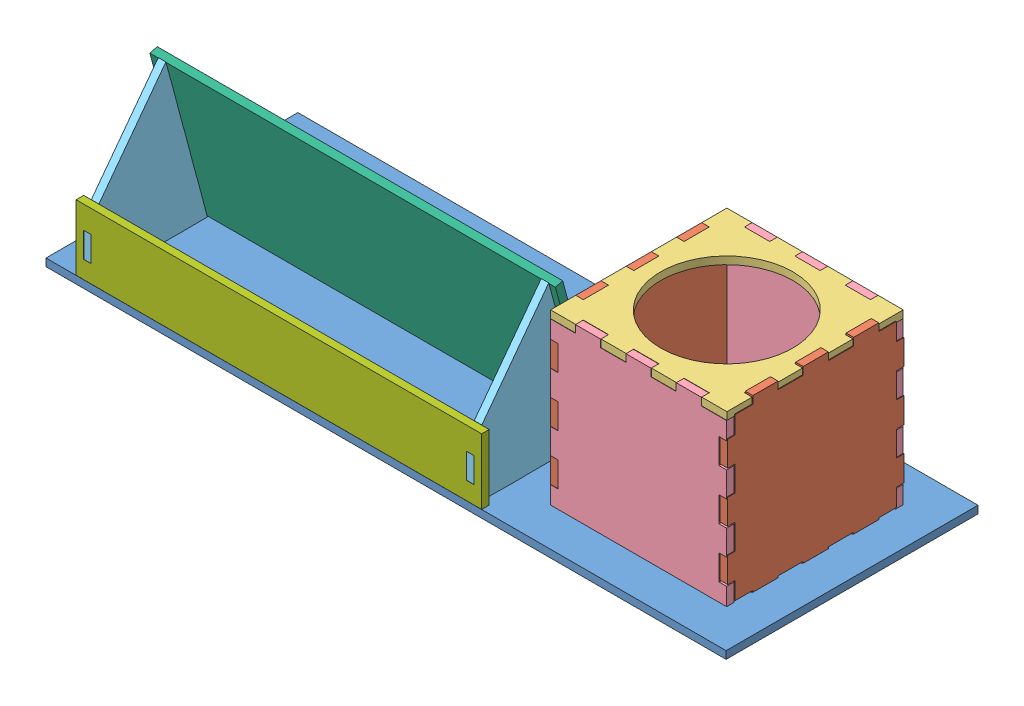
SolidWorks assembly assemble_penholder.SLDASM, configuration Default (file format 9000). Lengths in mm.
Overall size (270 70.65 100).
11 component instances, 7 part files, 6 mates.
Components (placement in the parent):
- base-1: base.SLDPRT [Default] at (126.5749 114.4552 210.5861) x (1 0 0) z (0 1 0) size (270 100 3)
- pen_holder-1: pen_holder.SLDASM [Default] at (207.373 92.8284 240.1996) x (0 0 -1) z (0 1 0) size (70.15 70.26 70.65)
  - Part2-1: Part2.SLDPRT [Default] at (-5.0591 27.8067 91.6268) x (0 0 -1) z (0 1 0) size (70 70 3)
  - Part3-3: Part3.SLDPRT [Default] at (23.6294 17.61 88.6268) size (70 70 3)
  - side_2-1: side_2.SLDPRT [Default] at (61.9409 -4.1933 56.6268) x (0 1 0) z (1 0 0) size (70 70 3)
  - side_2-2: side_2.SLDPRT [Default] at (-5.1755 -4.1933 56.6268) x (0 1 0) z (1 0 0) size (70 70 3)
  - Part2-4: Part2.SLDPRT [Default] at (-5.0288 -36.4567 92.2787) x (1 0 0) z (0 -1 0) size (70 70 3)
- side_support-1: side_support.SLDPRT [Default] at (161.5083 114.4552 260.5106) x (0 0 -1) z (1 0 0) size (47.41 64.56 3)
- side_support-2: side_support.SLDPRT [Default] at (9.532 114.4552 260.5525) x (0 0 -1) z (1 0 0) size (47.41 64.56 3)
- name_plate-1: name_plate.SLDPRT [Default] at (83.5814 149.1357 219.8032) x (1 0 0) z (0 -0.258819 0.965926) size (161 63 3)
- back_plate-1: back_plate.SLDPRT [Default] at (84.0008 130.4348 257.5525) x (1 0 0) z (0 -1 0) size (161 3 26)
Mates (geometry in assembly coordinates):
- Coincident1: coincident aligned: plane of base-1 through (126.5749 114.4552 210.5861) normal (0 -1 0); plane of pen_holder-1/side_2-2 through (176.5662 114.4552 242.3751) normal (0 -1 0)
- Coincident3: coincident aligned: plane of base-1 through (126.5749 114.4552 210.5861) normal (0 -1 0); plane of side_support-1 through (158.5083 114.4552 260.5106) normal (0 -1 0)
- Coincident4: coincident aligned: plane of base-1 through (126.5749 114.4552 210.5861) normal (0 -1 0); plane of side_support-2 through (6.532 114.4552 260.5525) normal (0 -1 0)
- Coincident5: coincident aligned: plane of base-1 through (126.5749 114.4552 210.5861) normal (0 -1 0); plane of side_support-2 through (6.532 114.4552 260.5525) normal (0 -1 0)
- Coincident7: coincident aligned: plane of side_support-1 through (158.5083 114.4552 210.5106) normal (0 0.258819 -0.965926); plane of name_plate-1 through (83.5814 149.1357 219.8032) normal (0 0.258819 -0.965926)
- Coincident8: coincident aligned: plane of side_support-2 through (6.532 114.4552 260.5525) normal (0 0 1); plane of back_plate-1 through (84.0008 130.4348 260.5525) normal (0 0 1)
